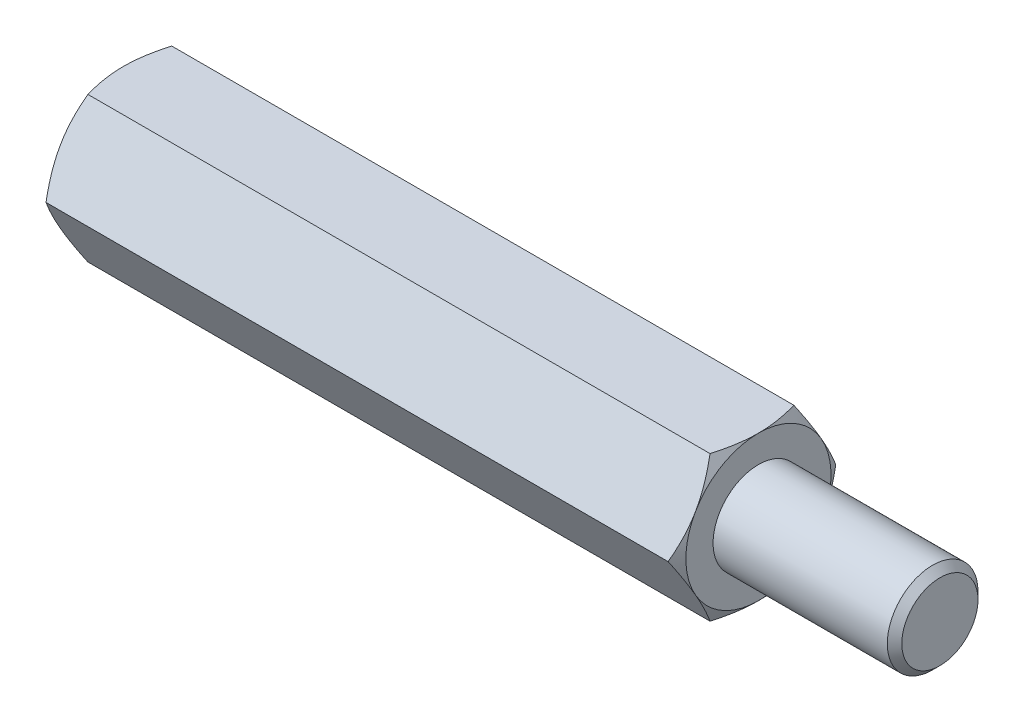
from build123d import *

# Parameters (mm, degrees)
EXTRUDE2_DEPTH = 17.5
SKETCH3_R      = 2.1
EXTRUDE3_DEPTH = 10
SKETCH5_R      = 2.5
EXTRUDE4_DEPTH = 10
CHAMFER1_SIZE  = 0.4


with BuildPart() as part:
    # Sketch1 → Extrude2 (new, symmetric)
    with BuildSketch(Plane(origin=(0, 0, 0), x_dir=(0, 0, -1), z_dir=(1, 0, 0))):
        Polygon((2.309401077, 4), (-2.309401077, 4), (-4.618802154, 0), (-2.309401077, -4), (2.309401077, -4), (4.618802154, 0), align=None)
    extrude(amount=EXTRUDE2_DEPTH, both=True)

    # Sketch2 → Cut-Revolve1 (revolve, cut)
    with BuildSketch(Plane.XY):
        with BuildLine():
            Line((-17.5, 4), (-16, 6.598076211))
            ThreePointArc((-16, 6.598076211), (-16.48810136, 7.776457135), (-17.5, 7))
            Line((-17.5, 7), (-17.5, 4))
        make_face()
    cut_revolve1 = revolve(axis=Axis((0, 0, 0), (1, 0, 0)), mode=Mode.SUBTRACT)

    # Mirror1: Cut-Revolve1 across plane
    add(cut_revolve1.mirror(Plane(origin=(0, 0, 0), x_dir=(0, 0, 1), z_dir=(1, 0, 0))), mode=Mode.SUBTRACT)

    # Sketch3 → Extrude3 (cut)
    with BuildSketch(Plane.ZY.offset(17.5)):
        Circle(SKETCH3_R)
    extrude(amount=-EXTRUDE3_DEPTH, mode=Mode.SUBTRACT)

    # Sketch4 → Cut-Revolve2 (revolve, cut)
    with BuildSketch(Plane.XY, mode=Mode.PRIVATE) as cut_revolve2_sk:
        Polygon((-7.5, 0), (-7.5, 2.1), (-6.287564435, 0), align=None)
    revolve(cut_revolve2_sk.sketch.rotate(Axis((-6.287564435, 0, 0), (-1, 0, 0)), 270), axis=Axis((-6.287564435, 0, 0), (-1, 0, 0)), mode=Mode.SUBTRACT)

    # Sketch5 → Extrude4 (add)
    with BuildSketch(Plane(origin=(17.5, 0, 0), x_dir=(0, 0, -1), z_dir=(1, 0, 0))):
        Circle(SKETCH5_R)
    extrude(amount=EXTRUDE4_DEPTH)

    # Chamfer1
    chamfer1_edges = [part.edges().sort_by_distance(p)[0] for p in [
        (27.5, 0, 2.5),
    ]]
    chamfer(chamfer1_edges, length=CHAMFER1_SIZE)


solid = part.part
